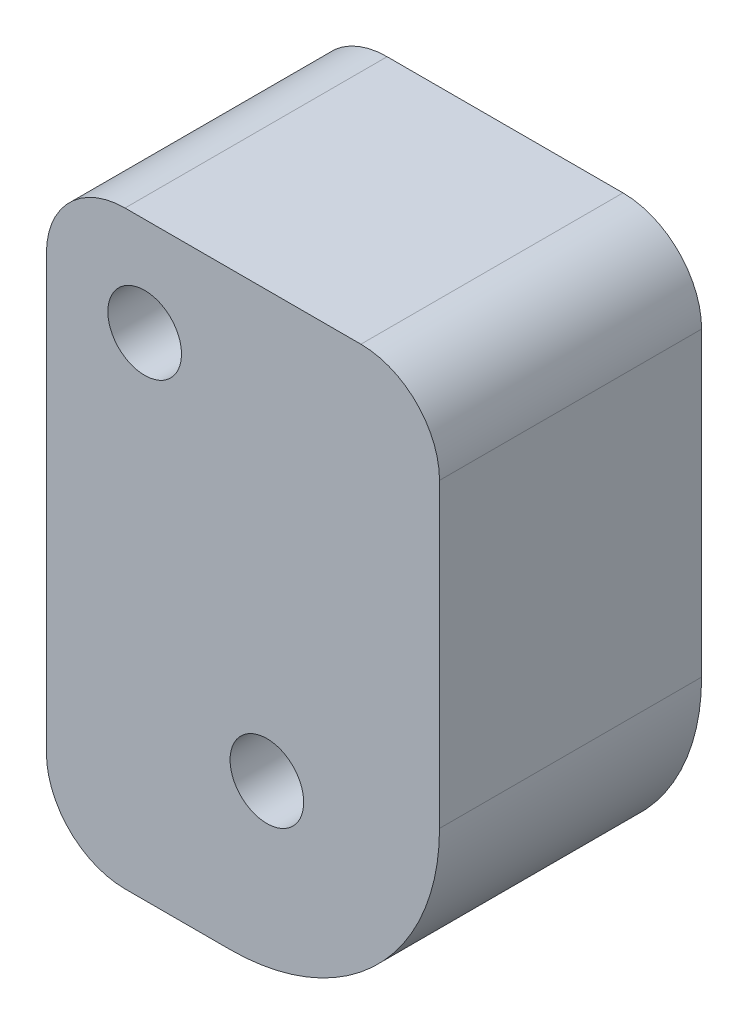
ISO-10303-21;
HEADER;
FILE_DESCRIPTION(('STEP AP214'),'2;1');
FILE_NAME('part.step','',(''),(''),'','','');
FILE_SCHEMA(('AUTOMOTIVE_DESIGN { 1 0 10303 214 1 1 1 1 }'));
ENDSEC;
DATA;
#1=APPLICATION_CONTEXT('core data for automotive mechanical design processes');
#2=APPLICATION_PROTOCOL_DEFINITION('international standard','automotive_design',2000,#1);
#3=PRODUCT_CONTEXT('',#1,'mechanical');
#4=PRODUCT('Part','Part','',(#3));
#5=PRODUCT_RELATED_PRODUCT_CATEGORY('part','',(#4));
#6=PRODUCT_DEFINITION_FORMATION('','',#4);
#7=PRODUCT_DEFINITION_CONTEXT('part definition',#1,'design');
#8=PRODUCT_DEFINITION('design','',#6,#7);
#9=PRODUCT_DEFINITION_SHAPE('','',#8);
#10=(LENGTH_UNIT() NAMED_UNIT(*) SI_UNIT(.MILLI.,.METRE.));
#11=(NAMED_UNIT(*) PLANE_ANGLE_UNIT() SI_UNIT($,.RADIAN.));
#12=(NAMED_UNIT(*) SI_UNIT($,.STERADIAN.) SOLID_ANGLE_UNIT());
#13=UNCERTAINTY_MEASURE_WITH_UNIT(LENGTH_MEASURE(1.E-05),#10,'distance_accuracy_value','');
#14=(GEOMETRIC_REPRESENTATION_CONTEXT(3) GLOBAL_UNCERTAINTY_ASSIGNED_CONTEXT((#13)) GLOBAL_UNIT_ASSIGNED_CONTEXT((#10,
#11,#12)) REPRESENTATION_CONTEXT('',''));
#15=CARTESIAN_POINT('',(0.,0.,0.));
#16=DIRECTION('',(0.,0.,1.));
#17=DIRECTION('',(1.,0.,0.));
#18=AXIS2_PLACEMENT_3D('',#15,#16,#17);
#19=CARTESIAN_POINT('',(-526.161,-26.6178402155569,28.5999999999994));
#20=DIRECTION('',(0.,0.,-1.));
#21=DIRECTION('',(-1.,0.,0.));
#22=AXIS2_PLACEMENT_3D('',#19,#20,#21);
#23=CYLINDRICAL_SURFACE('',#22,20.32);
#24=CARTESIAN_POINT('',(-526.161,-26.6178402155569,3.19999999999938));
#25=DIRECTION('',(0.,0.,-1.));
#26=DIRECTION('',(-1.,0.,0.));
#27=AXIS2_PLACEMENT_3D('',#24,#25,#26);
#28=CIRCLE('',#27,20.32);
#29=CARTESIAN_POINT('',(-505.841,-26.6178402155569,3.19999999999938));
#30=VERTEX_POINT('',#29);
#31=CARTESIAN_POINT('',(-526.161,-46.9378402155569,3.19999999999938));
#32=VERTEX_POINT('',#31);
#33=EDGE_CURVE('E157',#30,#32,#28,.T.);
#34=ORIENTED_EDGE('',*,*,#33,.F.);
#35=DIRECTION('',(0.,0.,-1.));
#36=VECTOR('',#35,1.);
#37=CARTESIAN_POINT('',(-505.841,-26.6178402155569,28.5999999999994));
#38=LINE('',#37,#36);
#39=CARTESIAN_POINT('',(-505.841,-26.6178402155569,28.5999999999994));
#40=VERTEX_POINT('',#39);
#41=EDGE_CURVE('E12',#40,#30,#38,.T.);
#42=ORIENTED_EDGE('',*,*,#41,.F.);
#43=CARTESIAN_POINT('',(-526.161,-26.6178402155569,28.5999999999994));
#44=DIRECTION('',(0.,0.,-1.));
#45=DIRECTION('',(-1.,0.,0.));
#46=AXIS2_PLACEMENT_3D('',#43,#44,#45);
#47=CIRCLE('',#46,20.32);
#48=CARTESIAN_POINT('',(-526.161,-46.9378402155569,28.5999999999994));
#49=VERTEX_POINT('',#48);
#50=EDGE_CURVE('E186',#40,#49,#47,.T.);
#51=ORIENTED_EDGE('',*,*,#50,.T.);
#52=DIRECTION('',(0.,0.,-1.));
#53=VECTOR('',#52,1.);
#54=CARTESIAN_POINT('',(-526.161,-46.9378402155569,28.5999999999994));
#55=LINE('',#54,#53);
#56=EDGE_CURVE('E56',#49,#32,#55,.T.);
#57=ORIENTED_EDGE('',*,*,#56,.T.);
#58=EDGE_LOOP('',(#34,#42,#51,#57));
#59=FACE_BOUND('',#58,.T.);
#60=ADVANCED_FACE('F53',(#59),#23,.T.);
#61=CARTESIAN_POINT('',(-505.841,2.59215978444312,28.5999999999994));
#62=DIRECTION('',(1.,0.,0.));
#63=DIRECTION('',(0.,1.,0.));
#64=AXIS2_PLACEMENT_3D('',#61,#62,#63);
#65=PLANE('',#64);
#66=DIRECTION('',(0.,-1.,0.));
#67=VECTOR('',#66,1.);
#68=CARTESIAN_POINT('',(-505.841,2.59215978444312,3.19999999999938));
#69=LINE('',#68,#67);
#70=CARTESIAN_POINT('',(-505.841,2.59215978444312,3.19999999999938));
#71=VERTEX_POINT('',#70);
#72=EDGE_CURVE('E183',#71,#30,#69,.T.);
#73=ORIENTED_EDGE('',*,*,#72,.F.);
#74=DIRECTION('',(0.,0.,-1.));
#75=VECTOR('',#74,1.);
#76=CARTESIAN_POINT('',(-505.841,2.59215978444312,28.5999999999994));
#77=LINE('',#76,#75);
#78=CARTESIAN_POINT('',(-505.841,2.59215978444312,28.5999999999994));
#79=VERTEX_POINT('',#78);
#80=EDGE_CURVE('E63',#79,#71,#77,.T.);
#81=ORIENTED_EDGE('',*,*,#80,.F.);
#82=DIRECTION('',(0.,-1.,0.));
#83=VECTOR('',#82,1.);
#84=CARTESIAN_POINT('',(-505.841,2.59215978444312,28.5999999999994));
#85=LINE('',#84,#83);
#86=EDGE_CURVE('E142',#79,#40,#85,.T.);
#87=ORIENTED_EDGE('',*,*,#86,.T.);
#88=ORIENTED_EDGE('',*,*,#41,.T.);
#89=EDGE_LOOP('',(#73,#81,#87,#88));
#90=FACE_BOUND('',#89,.T.);
#91=ADVANCED_FACE('F206',(#90),#65,.T.);
#92=CARTESIAN_POINT('',(-513.461,2.59215978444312,28.5999999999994));
#93=DIRECTION('',(0.,0.,-1.));
#94=DIRECTION('',(-1.,0.,0.));
#95=AXIS2_PLACEMENT_3D('',#92,#93,#94);
#96=CYLINDRICAL_SURFACE('',#95,7.61999999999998);
#97=CARTESIAN_POINT('',(-513.461,2.59215978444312,3.19999999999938));
#98=DIRECTION('',(0.,0.,-1.));
#99=DIRECTION('',(1.,0.,0.));
#100=AXIS2_PLACEMENT_3D('',#97,#98,#99);
#101=CIRCLE('',#100,7.61999999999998);
#102=CARTESIAN_POINT('',(-513.461,10.2121597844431,3.19999999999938));
#103=VERTEX_POINT('',#102);
#104=EDGE_CURVE('E128',#103,#71,#101,.T.);
#105=ORIENTED_EDGE('',*,*,#104,.F.);
#106=DIRECTION('',(0.,0.,-1.));
#107=VECTOR('',#106,1.);
#108=CARTESIAN_POINT('',(-513.461,10.2121597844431,28.5999999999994));
#109=LINE('',#108,#107);
#110=CARTESIAN_POINT('',(-513.461,10.2121597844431,28.5999999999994));
#111=VERTEX_POINT('',#110);
#112=EDGE_CURVE('E123',#111,#103,#109,.T.);
#113=ORIENTED_EDGE('',*,*,#112,.F.);
#114=CARTESIAN_POINT('',(-513.461,2.59215978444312,28.5999999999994));
#115=DIRECTION('',(0.,0.,-1.));
#116=DIRECTION('',(1.,0.,0.));
#117=AXIS2_PLACEMENT_3D('',#114,#115,#116);
#118=CIRCLE('',#117,7.61999999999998);
#119=EDGE_CURVE('E126',#111,#79,#118,.T.);
#120=ORIENTED_EDGE('',*,*,#119,.T.);
#121=ORIENTED_EDGE('',*,*,#80,.T.);
#122=EDGE_LOOP('',(#105,#113,#120,#121));
#123=FACE_BOUND('',#122,.T.);
#124=ADVANCED_FACE('F125',(#123),#96,.T.);
#125=CARTESIAN_POINT('',(-513.461,10.2121597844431,28.5999999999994));
#126=DIRECTION('',(0.,1.,0.));
#127=DIRECTION('',(-1.,0.,0.));
#128=AXIS2_PLACEMENT_3D('',#125,#126,#127);
#129=PLANE('',#128);
#130=DIRECTION('',(1.,0.,0.));
#131=VECTOR('',#130,1.);
#132=CARTESIAN_POINT('',(-513.461,10.2121597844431,3.19999999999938));
#133=LINE('',#132,#131);
#134=CARTESIAN_POINT('',(-536.321,10.2121597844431,3.19999999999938));
#135=VERTEX_POINT('',#134);
#136=EDGE_CURVE('E178',#135,#103,#133,.T.);
#137=ORIENTED_EDGE('',*,*,#136,.F.);
#138=DIRECTION('',(0.,0.,-1.));
#139=VECTOR('',#138,1.);
#140=CARTESIAN_POINT('',(-536.321,10.2121597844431,28.5999999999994));
#141=LINE('',#140,#139);
#142=CARTESIAN_POINT('',(-536.321,10.2121597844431,28.5999999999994));
#143=VERTEX_POINT('',#142);
#144=EDGE_CURVE('E134',#143,#135,#141,.T.);
#145=ORIENTED_EDGE('',*,*,#144,.F.);
#146=DIRECTION('',(1.,0.,0.));
#147=VECTOR('',#146,1.);
#148=CARTESIAN_POINT('',(-513.461,10.2121597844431,28.5999999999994));
#149=LINE('',#148,#147);
#150=EDGE_CURVE('E140',#143,#111,#149,.T.);
#151=ORIENTED_EDGE('',*,*,#150,.T.);
#152=ORIENTED_EDGE('',*,*,#112,.T.);
#153=EDGE_LOOP('',(#137,#145,#151,#152));
#154=FACE_BOUND('',#153,.T.);
#155=ADVANCED_FACE('F145',(#154),#129,.T.);
#156=CARTESIAN_POINT('',(-536.321,2.59215978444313,28.5999999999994));
#157=DIRECTION('',(0.,0.,-1.));
#158=DIRECTION('',(-1.,0.,0.));
#159=AXIS2_PLACEMENT_3D('',#156,#157,#158);
#160=CYLINDRICAL_SURFACE('',#159,7.61999999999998);
#161=CARTESIAN_POINT('',(-536.321,2.59215978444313,3.19999999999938));
#162=DIRECTION('',(0.,0.,-1.));
#163=DIRECTION('',(1.,0.,0.));
#164=AXIS2_PLACEMENT_3D('',#161,#162,#163);
#165=CIRCLE('',#164,7.61999999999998);
#166=CARTESIAN_POINT('',(-543.941,2.59215978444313,3.19999999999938));
#167=VERTEX_POINT('',#166);
#168=EDGE_CURVE('E174',#167,#135,#165,.T.);
#169=ORIENTED_EDGE('',*,*,#168,.F.);
#170=DIRECTION('',(0.,0.,-1.));
#171=VECTOR('',#170,1.);
#172=CARTESIAN_POINT('',(-543.941,2.59215978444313,28.5999999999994));
#173=LINE('',#172,#171);
#174=CARTESIAN_POINT('',(-543.941,2.59215978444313,28.5999999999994));
#175=VERTEX_POINT('',#174);
#176=EDGE_CURVE('E192',#175,#167,#173,.T.);
#177=ORIENTED_EDGE('',*,*,#176,.F.);
#178=CARTESIAN_POINT('',(-536.321,2.59215978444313,28.5999999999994));
#179=DIRECTION('',(0.,0.,-1.));
#180=DIRECTION('',(1.,0.,0.));
#181=AXIS2_PLACEMENT_3D('',#178,#179,#180);
#182=CIRCLE('',#181,7.61999999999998);
#183=EDGE_CURVE('E147',#175,#143,#182,.T.);
#184=ORIENTED_EDGE('',*,*,#183,.T.);
#185=ORIENTED_EDGE('',*,*,#144,.T.);
#186=EDGE_LOOP('',(#169,#177,#184,#185));
#187=FACE_BOUND('',#186,.T.);
#188=ADVANCED_FACE('F219',(#187),#160,.T.);
#189=CARTESIAN_POINT('',(-543.941,2.59215978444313,28.5999999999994));
#190=DIRECTION('',(-1.,0.,0.));
#191=DIRECTION('',(0.,0.,1.));
#192=AXIS2_PLACEMENT_3D('',#189,#190,#191);
#193=PLANE('',#192);
#194=DIRECTION('',(0.,1.,0.));
#195=VECTOR('',#194,1.);
#196=CARTESIAN_POINT('',(-543.941,2.59215978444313,3.19999999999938));
#197=LINE('',#196,#195);
#198=CARTESIAN_POINT('',(-543.941,-39.3178402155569,3.19999999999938));
#199=VERTEX_POINT('',#198);
#200=EDGE_CURVE('E170',#199,#167,#197,.T.);
#201=ORIENTED_EDGE('',*,*,#200,.F.);
#202=DIRECTION('',(0.,0.,-1.));
#203=VECTOR('',#202,1.);
#204=CARTESIAN_POINT('',(-543.941,-39.3178402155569,28.5999999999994));
#205=LINE('',#204,#203);
#206=CARTESIAN_POINT('',(-543.941,-39.3178402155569,28.5999999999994));
#207=VERTEX_POINT('',#206);
#208=EDGE_CURVE('E195',#207,#199,#205,.T.);
#209=ORIENTED_EDGE('',*,*,#208,.F.);
#210=DIRECTION('',(0.,1.,0.));
#211=VECTOR('',#210,1.);
#212=CARTESIAN_POINT('',(-543.941,2.59215978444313,28.5999999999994));
#213=LINE('',#212,#211);
#214=EDGE_CURVE('E151',#207,#175,#213,.T.);
#215=ORIENTED_EDGE('',*,*,#214,.T.);
#216=ORIENTED_EDGE('',*,*,#176,.T.);
#217=EDGE_LOOP('',(#201,#209,#215,#216));
#218=FACE_BOUND('',#217,.T.);
#219=ADVANCED_FACE('F222',(#218),#193,.T.);
#220=CARTESIAN_POINT('',(-536.321,-39.3178402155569,28.5999999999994));
#221=DIRECTION('',(0.,0.,-1.));
#222=DIRECTION('',(-1.,0.,0.));
#223=AXIS2_PLACEMENT_3D('',#220,#221,#222);
#224=CYLINDRICAL_SURFACE('',#223,7.61999999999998);
#225=CARTESIAN_POINT('',(-536.321,-39.3178402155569,3.19999999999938));
#226=DIRECTION('',(0.,0.,-1.));
#227=DIRECTION('',(1.,0.,0.));
#228=AXIS2_PLACEMENT_3D('',#225,#226,#227);
#229=CIRCLE('',#228,7.61999999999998);
#230=CARTESIAN_POINT('',(-536.321,-46.9378402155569,3.19999999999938));
#231=VERTEX_POINT('',#230);
#232=EDGE_CURVE('E166',#231,#199,#229,.T.);
#233=ORIENTED_EDGE('',*,*,#232,.F.);
#234=DIRECTION('',(0.,0.,-1.));
#235=VECTOR('',#234,1.);
#236=CARTESIAN_POINT('',(-536.321,-46.9378402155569,28.5999999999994));
#237=LINE('',#236,#235);
#238=CARTESIAN_POINT('',(-536.321,-46.9378402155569,28.5999999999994));
#239=VERTEX_POINT('',#238);
#240=EDGE_CURVE('E197',#239,#231,#237,.T.);
#241=ORIENTED_EDGE('',*,*,#240,.F.);
#242=CARTESIAN_POINT('',(-536.321,-39.3178402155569,28.5999999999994));
#243=DIRECTION('',(0.,0.,-1.));
#244=DIRECTION('',(1.,0.,0.));
#245=AXIS2_PLACEMENT_3D('',#242,#243,#244);
#246=CIRCLE('',#245,7.61999999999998);
#247=EDGE_CURVE('E315',#239,#207,#246,.T.);
#248=ORIENTED_EDGE('',*,*,#247,.T.);
#249=ORIENTED_EDGE('',*,*,#208,.T.);
#250=EDGE_LOOP('',(#233,#241,#248,#249));
#251=FACE_BOUND('',#250,.T.);
#252=ADVANCED_FACE('F226',(#251),#224,.T.);
#253=CARTESIAN_POINT('',(-526.161,-46.9378402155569,28.5999999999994));
#254=DIRECTION('',(0.,-1.,0.));
#255=DIRECTION('',(1.,0.,0.));
#256=AXIS2_PLACEMENT_3D('',#253,#254,#255);
#257=PLANE('',#256);
#258=DIRECTION('',(-1.,0.,0.));
#259=VECTOR('',#258,1.);
#260=CARTESIAN_POINT('',(-526.161,-46.9378402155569,3.19999999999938));
#261=LINE('',#260,#259);
#262=EDGE_CURVE('E161',#32,#231,#261,.T.);
#263=ORIENTED_EDGE('',*,*,#262,.F.);
#264=ORIENTED_EDGE('',*,*,#56,.F.);
#265=DIRECTION('',(-1.,0.,0.));
#266=VECTOR('',#265,1.);
#267=CARTESIAN_POINT('',(-526.161,-46.9378402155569,28.5999999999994));
#268=LINE('',#267,#266);
#269=EDGE_CURVE('E312',#49,#239,#268,.T.);
#270=ORIENTED_EDGE('',*,*,#269,.T.);
#271=ORIENTED_EDGE('',*,*,#240,.T.);
#272=EDGE_LOOP('',(#263,#264,#270,#271));
#273=FACE_BOUND('',#272,.T.);
#274=ADVANCED_FACE('F203',(#273),#257,.T.);
#275=CARTESIAN_POINT('',(-526.161,-26.6178402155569,28.5999999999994));
#276=DIRECTION('',(0.,0.,-1.));
#277=DIRECTION('',(-1.,0.,0.));
#278=AXIS2_PLACEMENT_3D('',#275,#276,#277);
#279=PLANE('',#278);
#280=CARTESIAN_POINT('',(-522.572795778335,-31.0085922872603,28.5999999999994));
#281=DIRECTION('',(0.,0.,-1.));
#282=DIRECTION('',(-1.,0.,0.));
#283=AXIS2_PLACEMENT_3D('',#280,#281,#282);
#284=CIRCLE('',#283,3.56869999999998);
#285=CARTESIAN_POINT('',(-526.141495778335,-31.0085922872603,28.5999999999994));
#286=VERTEX_POINT('',#285);
#287=EDGE_CURVE('E267',#286,#286,#284,.T.);
#288=ORIENTED_EDGE('',*,*,#287,.T.);
#289=EDGE_LOOP('',(#288));
#290=FACE_BOUND('',#289,.T.);
#291=CARTESIAN_POINT('',(-534.416,0.687159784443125,28.5999999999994));
#292=DIRECTION('',(0.,0.,-1.));
#293=DIRECTION('',(-1.,0.,0.));
#294=AXIS2_PLACEMENT_3D('',#291,#292,#293);
#295=CIRCLE('',#294,3.56869999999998);
#296=CARTESIAN_POINT('',(-537.9847,0.687159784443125,28.5999999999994));
#297=VERTEX_POINT('',#296);
#298=EDGE_CURVE('E299',#297,#297,#295,.T.);
#299=ORIENTED_EDGE('',*,*,#298,.T.);
#300=EDGE_LOOP('',(#299));
#301=FACE_BOUND('',#300,.T.);
#302=ORIENTED_EDGE('',*,*,#50,.F.);
#303=ORIENTED_EDGE('',*,*,#86,.F.);
#304=ORIENTED_EDGE('',*,*,#119,.F.);
#305=ORIENTED_EDGE('',*,*,#150,.F.);
#306=ORIENTED_EDGE('',*,*,#183,.F.);
#307=ORIENTED_EDGE('',*,*,#214,.F.);
#308=ORIENTED_EDGE('',*,*,#247,.F.);
#309=ORIENTED_EDGE('',*,*,#269,.F.);
#310=EDGE_LOOP('',(#302,#303,#304,#305,#306,#307,#308,#309));
#311=FACE_BOUND('',#310,.T.);
#312=ADVANCED_FACE('F138',(#290,#301,#311),#279,.F.);
#313=CARTESIAN_POINT('',(-526.161,-26.6178402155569,3.19999999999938));
#314=DIRECTION('',(0.,0.,-1.));
#315=DIRECTION('',(-1.,0.,0.));
#316=AXIS2_PLACEMENT_3D('',#313,#314,#315);
#317=PLANE('',#316);
#318=CARTESIAN_POINT('',(-522.572795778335,-31.0085922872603,3.19999999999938));
#319=DIRECTION('',(0.,0.,-1.));
#320=DIRECTION('',(-1.,0.,0.));
#321=AXIS2_PLACEMENT_3D('',#318,#319,#320);
#322=CIRCLE('',#321,5.35940000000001);
#323=CARTESIAN_POINT('',(-527.932195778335,-31.0085922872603,3.19999999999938));
#324=VERTEX_POINT('',#323);
#325=EDGE_CURVE('E278',#324,#324,#322,.T.);
#326=ORIENTED_EDGE('',*,*,#325,.F.);
#327=EDGE_LOOP('',(#326));
#328=FACE_BOUND('',#327,.T.);
#329=CARTESIAN_POINT('',(-534.416,0.687159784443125,3.19999999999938));
#330=DIRECTION('',(0.,0.,-1.));
#331=DIRECTION('',(-1.,0.,0.));
#332=AXIS2_PLACEMENT_3D('',#329,#330,#331);
#333=CIRCLE('',#332,5.35940000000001);
#334=CARTESIAN_POINT('',(-539.7754,0.687159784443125,3.19999999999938));
#335=VERTEX_POINT('',#334);
#336=EDGE_CURVE('E162',#335,#335,#333,.T.);
#337=ORIENTED_EDGE('',*,*,#336,.F.);
#338=EDGE_LOOP('',(#337));
#339=FACE_BOUND('',#338,.T.);
#340=ORIENTED_EDGE('',*,*,#33,.T.);
#341=ORIENTED_EDGE('',*,*,#262,.T.);
#342=ORIENTED_EDGE('',*,*,#232,.T.);
#343=ORIENTED_EDGE('',*,*,#200,.T.);
#344=ORIENTED_EDGE('',*,*,#168,.T.);
#345=ORIENTED_EDGE('',*,*,#136,.T.);
#346=ORIENTED_EDGE('',*,*,#104,.T.);
#347=ORIENTED_EDGE('',*,*,#72,.T.);
#348=EDGE_LOOP('',(#340,#341,#342,#343,#344,#345,#346,#347));
#349=FACE_BOUND('',#348,.T.);
#350=ADVANCED_FACE('F205',(#328,#339,#349),#317,.T.);
#351=CARTESIAN_POINT('',(-534.416,0.687159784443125,3.19999999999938));
#352=DIRECTION('',(0.,0.,-1.));
#353=DIRECTION('',(-1.,0.,0.));
#354=AXIS2_PLACEMENT_3D('',#351,#352,#353);
#355=CYLINDRICAL_SURFACE('',#354,5.35940000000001);
#356=CARTESIAN_POINT('',(-534.416,0.687159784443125,12.0899999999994));
#357=DIRECTION('',(0.,0.,-1.));
#358=DIRECTION('',(-1.,0.,0.));
#359=AXIS2_PLACEMENT_3D('',#356,#357,#358);
#360=CIRCLE('',#359,5.35940000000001);
#361=CARTESIAN_POINT('',(-539.7754,0.687159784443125,12.0899999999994));
#362=VERTEX_POINT('',#361);
#363=EDGE_CURVE('E298',#362,#362,#360,.T.);
#364=ORIENTED_EDGE('',*,*,#363,.F.);
#365=EDGE_LOOP('',(#364));
#366=FACE_BOUND('',#365,.T.);
#367=ORIENTED_EDGE('',*,*,#336,.T.);
#368=EDGE_LOOP('',(#367));
#369=FACE_BOUND('',#368,.T.);
#370=ADVANCED_FACE('F238',(#366,#369),#355,.F.);
#371=CARTESIAN_POINT('',(-530.8473,0.687159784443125,12.0899999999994));
#372=DIRECTION('',(0.,0.,1.));
#373=DIRECTION('',(1.,0.,0.));
#374=AXIS2_PLACEMENT_3D('',#371,#372,#373);
#375=PLANE('',#374);
#376=CARTESIAN_POINT('',(-534.416,0.687159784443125,12.0899999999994));
#377=DIRECTION('',(0.,0.,-1.));
#378=DIRECTION('',(-1.,0.,0.));
#379=AXIS2_PLACEMENT_3D('',#376,#377,#378);
#380=CIRCLE('',#379,3.56869999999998);
#381=CARTESIAN_POINT('',(-537.9847,0.687159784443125,12.0899999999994));
#382=VERTEX_POINT('',#381);
#383=EDGE_CURVE('E293',#382,#382,#380,.T.);
#384=ORIENTED_EDGE('',*,*,#383,.F.);
#385=EDGE_LOOP('',(#384));
#386=FACE_BOUND('',#385,.T.);
#387=ORIENTED_EDGE('',*,*,#363,.T.);
#388=EDGE_LOOP('',(#387));
#389=FACE_BOUND('',#388,.T.);
#390=ADVANCED_FACE('F244',(#386,#389),#375,.F.);
#391=CARTESIAN_POINT('',(-534.416,0.687159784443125,3.19999999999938));
#392=DIRECTION('',(0.,0.,-1.));
#393=DIRECTION('',(-1.,0.,0.));
#394=AXIS2_PLACEMENT_3D('',#391,#392,#393);
#395=CYLINDRICAL_SURFACE('',#394,3.56869999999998);
#396=ORIENTED_EDGE('',*,*,#298,.F.);
#397=EDGE_LOOP('',(#396));
#398=FACE_BOUND('',#397,.T.);
#399=ORIENTED_EDGE('',*,*,#383,.T.);
#400=EDGE_LOOP('',(#399));
#401=FACE_BOUND('',#400,.T.);
#402=ADVANCED_FACE('F248',(#398,#401),#395,.F.);
#403=CARTESIAN_POINT('',(-522.572795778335,-31.0085922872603,3.19999999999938));
#404=DIRECTION('',(0.,0.,-1.));
#405=DIRECTION('',(-1.,0.,0.));
#406=AXIS2_PLACEMENT_3D('',#403,#404,#405);
#407=CYLINDRICAL_SURFACE('',#406,5.35940000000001);
#408=CARTESIAN_POINT('',(-522.572795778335,-31.0085922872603,12.0899999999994));
#409=DIRECTION('',(0.,0.,-1.));
#410=DIRECTION('',(-1.,0.,0.));
#411=AXIS2_PLACEMENT_3D('',#408,#409,#410);
#412=CIRCLE('',#411,5.35940000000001);
#413=CARTESIAN_POINT('',(-527.932195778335,-31.0085922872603,12.0899999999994));
#414=VERTEX_POINT('',#413);
#415=EDGE_CURVE('E272',#414,#414,#412,.T.);
#416=ORIENTED_EDGE('',*,*,#415,.F.);
#417=EDGE_LOOP('',(#416));
#418=FACE_BOUND('',#417,.T.);
#419=ORIENTED_EDGE('',*,*,#325,.T.);
#420=EDGE_LOOP('',(#419));
#421=FACE_BOUND('',#420,.T.);
#422=ADVANCED_FACE('F252',(#418,#421),#407,.F.);
#423=CARTESIAN_POINT('',(-519.004095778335,-31.0085922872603,12.0899999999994));
#424=DIRECTION('',(0.,0.,1.));
#425=DIRECTION('',(1.,0.,0.));
#426=AXIS2_PLACEMENT_3D('',#423,#424,#425);
#427=PLANE('',#426);
#428=CARTESIAN_POINT('',(-522.572795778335,-31.0085922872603,12.0899999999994));
#429=DIRECTION('',(0.,0.,-1.));
#430=DIRECTION('',(-1.,0.,0.));
#431=AXIS2_PLACEMENT_3D('',#428,#429,#430);
#432=CIRCLE('',#431,3.56869999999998);
#433=CARTESIAN_POINT('',(-526.141495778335,-31.0085922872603,12.0899999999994));
#434=VERTEX_POINT('',#433);
#435=EDGE_CURVE('E270',#434,#434,#432,.T.);
#436=ORIENTED_EDGE('',*,*,#435,.F.);
#437=EDGE_LOOP('',(#436));
#438=FACE_BOUND('',#437,.T.);
#439=ORIENTED_EDGE('',*,*,#415,.T.);
#440=EDGE_LOOP('',(#439));
#441=FACE_BOUND('',#440,.T.);
#442=ADVANCED_FACE('F256',(#438,#441),#427,.F.);
#443=CARTESIAN_POINT('',(-522.572795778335,-31.0085922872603,3.19999999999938));
#444=DIRECTION('',(0.,0.,-1.));
#445=DIRECTION('',(-1.,0.,0.));
#446=AXIS2_PLACEMENT_3D('',#443,#444,#445);
#447=CYLINDRICAL_SURFACE('',#446,3.56869999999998);
#448=ORIENTED_EDGE('',*,*,#287,.F.);
#449=EDGE_LOOP('',(#448));
#450=FACE_BOUND('',#449,.T.);
#451=ORIENTED_EDGE('',*,*,#435,.T.);
#452=EDGE_LOOP('',(#451));
#453=FACE_BOUND('',#452,.T.);
#454=ADVANCED_FACE('F260',(#450,#453),#447,.F.);
#455=CLOSED_SHELL('',(#60,#91,#124,#155,#188,#219,#252,#274,#312,#350,#370,#390,#402,#422,#442,#454));
#456=MANIFOLD_SOLID_BREP('B2',#455);
#457=ADVANCED_BREP_SHAPE_REPRESENTATION('',(#18,#456),#14);
#458=SHAPE_DEFINITION_REPRESENTATION(#9,#457);
ENDSEC;
END-ISO-10303-21;
